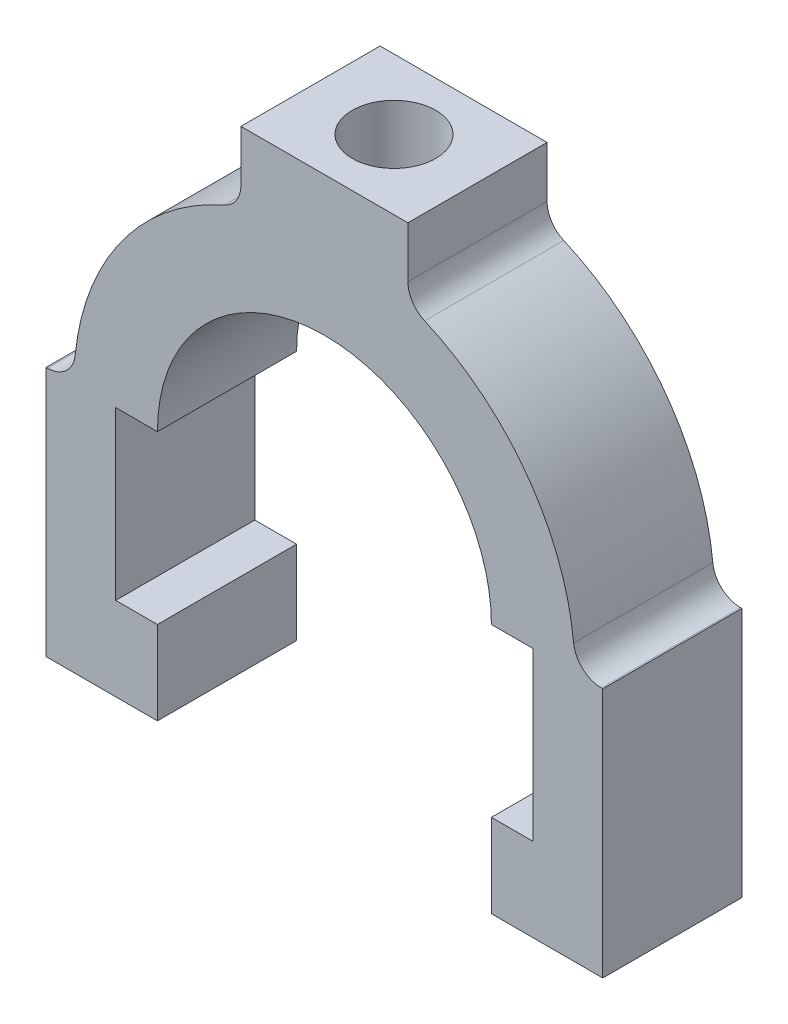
from build123d import *

# Parameters (mm, degrees)
BOSS_EXTRUDE1_DEPTH     = 10
CUT_EXTRUDE1_REACH      = 92
CUT_EXTRUDE1_END_RADIUS = 24
SKETCH2_R               = 6
FILLET1_R               = 4


with BuildPart() as part:
    # Sketch1 → Boss-Extrude1 (new, symmetric)
    with BuildSketch(Plane.XY):
        with BuildLine():
            Line((30, 6), (30, 30))
            Line((30, 30), (24, 30))
            ThreePointArc((24, 30), (0, 54), (-24, 30))
            Line((-24, 30), (-30, 30))
            Line((-30, 30), (-30, 6))
            Line((-30, 6), (-24, 6))
            Line((-24, 6), (-24, -6))
            Line((-24, -6), (-30, -6))
            Line((-30, -6), (-40, -6))
            Line((-40, -6), (-40, 30))
            Line((-40, 30), (-36, 30))
            ThreePointArc((-36, 30), (-29.393876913, 50.784609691), (-12, 63.941125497))
            Line((-12, 63.941125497), (-12, 74))
            Line((-12, 74), (12, 74))
            Line((12, 74), (12, 63.941125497))
            ThreePointArc((12, 63.941125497), (29.393876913, 50.784609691), (36, 30))
            Line((36, 30), (40, 30))
            Line((40, 30), (40, -6))
            Line((40, -6), (30, -6))
            Line((30, -6), (24, -6))
            Line((24, -6), (24, 6))
            Line((24, 6), (30, 6))
        make_face()
    extrude(amount=BOSS_EXTRUDE1_DEPTH, both=True)

    # Cut-Extrude1: up to this cylinder (the profile starts outside it)
    cut_extrude1_end = Plane(origin=(0, 30, 0), z_dir=(0, 0, -1)) * Cylinder(CUT_EXTRUDE1_END_RADIUS, 233, mode=Mode.PRIVATE)
    # Sketch2 → Cut-Extrude1 (cut, up to the surface)
    with BuildSketch(Plane(origin=(0, 74, 0), x_dir=(1, 0, 0), z_dir=(0, 1, 0)), mode=Mode.PRIVATE) as cut_extrude1_sk1:
        with Locations(Location((0, 0, 0), (0, 0, 270))):
            Circle(SKETCH2_R)
    cut_extrude1_tool1 = extrude(cut_extrude1_sk1.sketch, amount=-CUT_EXTRUDE1_REACH, mode=Mode.PRIVATE) - cut_extrude1_end
    add(cut_extrude1_tool1.solids().sort_by_distance((0, 74, 0))[0], mode=Mode.SUBTRACT)

    # Fillet1
    fillet1_edges = [part.edges().sort_by_distance(p)[0] for p in [
        (-36, 30, 0),
        (-12, 63.941125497, 0),
        (12, 63.941125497, 0),
        (36, 30, 0),
    ]]
    fillet(fillet1_edges, radius=FILLET1_R)


solid = part.part
